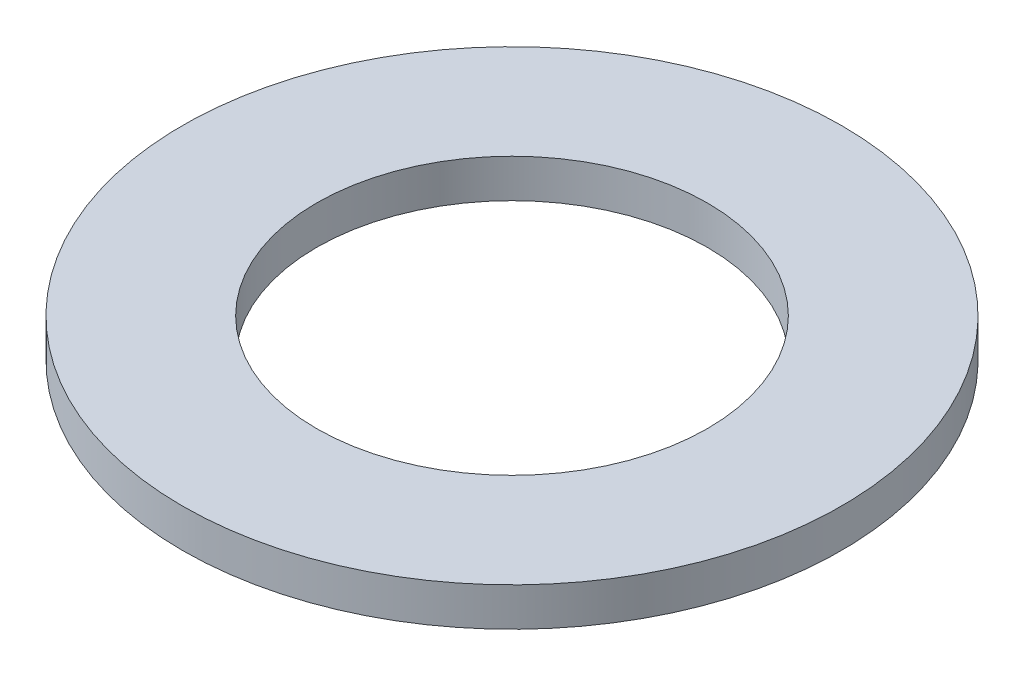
from build123d import *

# Parameters (mm, degrees)
SKETCH1_R           = 27.178
SKETCH1_R_2         = 16.1163
BOSS_EXTRUDE1_DEPTH = 3.175


with BuildPart() as part:
    # Sketch1 → Boss-Extrude1 (new body)
    with BuildSketch(Plane(origin=(0, 0, 0), x_dir=(1, 0, 0), z_dir=(0, 1, 0))):
        with Locations(Location((0, 0, 0), (0, 0, 270))):
            Circle(SKETCH1_R)
        with Locations(Location((0, 0, 0), (0, 0, 270))):
            Circle(SKETCH1_R_2, mode=Mode.SUBTRACT)
    extrude(amount=BOSS_EXTRUDE1_DEPTH)


solid = part.part
